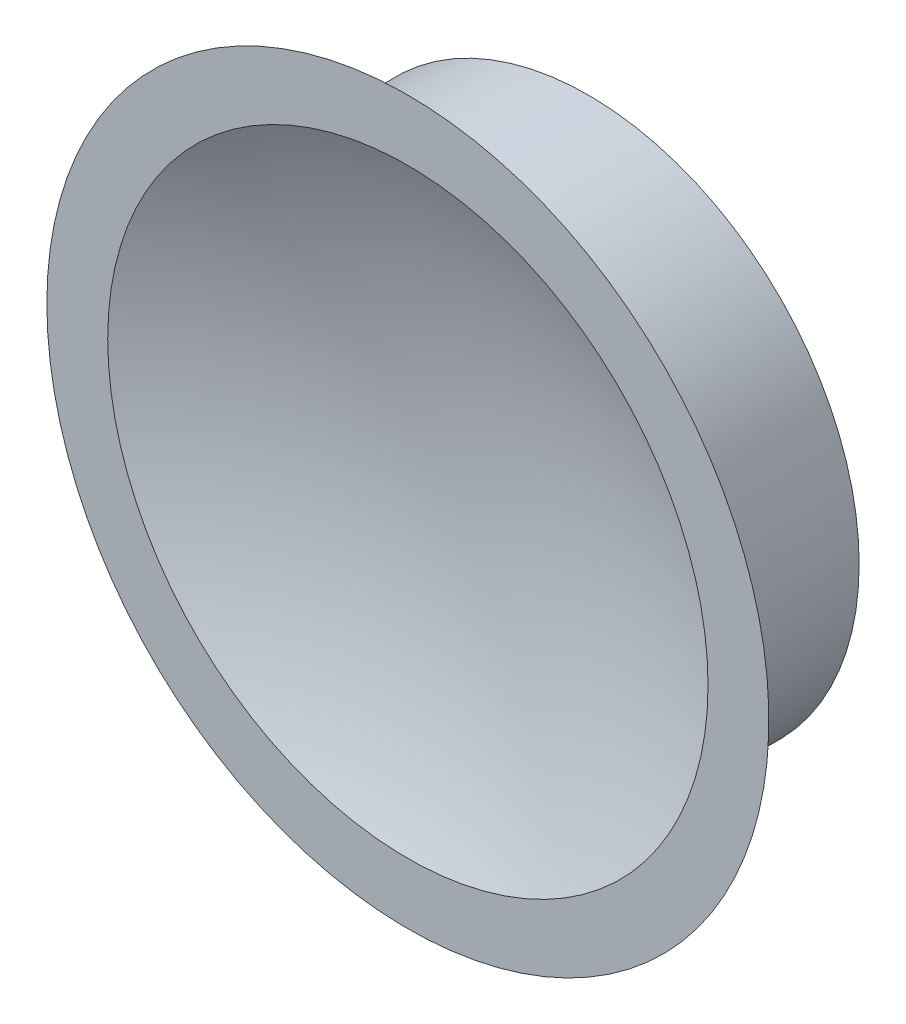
ISO-10303-21;
HEADER;
FILE_DESCRIPTION(('STEP AP214'),'2;1');
FILE_NAME('part.step','',(''),(''),'','','');
FILE_SCHEMA(('AUTOMOTIVE_DESIGN { 1 0 10303 214 1 1 1 1 }'));
ENDSEC;
DATA;
#1=APPLICATION_CONTEXT('core data for automotive mechanical design processes');
#2=APPLICATION_PROTOCOL_DEFINITION('international standard','automotive_design',2000,#1);
#3=PRODUCT_CONTEXT('',#1,'mechanical');
#4=PRODUCT('Part','Part','',(#3));
#5=PRODUCT_RELATED_PRODUCT_CATEGORY('part','',(#4));
#6=PRODUCT_DEFINITION_FORMATION('','',#4);
#7=PRODUCT_DEFINITION_CONTEXT('part definition',#1,'design');
#8=PRODUCT_DEFINITION('design','',#6,#7);
#9=PRODUCT_DEFINITION_SHAPE('','',#8);
#10=(LENGTH_UNIT() NAMED_UNIT(*) SI_UNIT(.MILLI.,.METRE.));
#11=(NAMED_UNIT(*) PLANE_ANGLE_UNIT() SI_UNIT($,.RADIAN.));
#12=(NAMED_UNIT(*) SI_UNIT($,.STERADIAN.) SOLID_ANGLE_UNIT());
#13=UNCERTAINTY_MEASURE_WITH_UNIT(LENGTH_MEASURE(1.E-05),#10,'distance_accuracy_value','');
#14=(GEOMETRIC_REPRESENTATION_CONTEXT(3) GLOBAL_UNCERTAINTY_ASSIGNED_CONTEXT((#13)) GLOBAL_UNIT_ASSIGNED_CONTEXT((#10,
#11,#12)) REPRESENTATION_CONTEXT('',''));
#15=CARTESIAN_POINT('',(0.,0.,0.));
#16=DIRECTION('',(0.,0.,1.));
#17=DIRECTION('',(1.,0.,0.));
#18=AXIS2_PLACEMENT_3D('',#15,#16,#17);
#19=CARTESIAN_POINT('',(0.,0.,0.));
#20=DIRECTION('',(0.,0.,-1.));
#21=DIRECTION('',(-1.,0.,0.));
#22=AXIS2_PLACEMENT_3D('',#19,#20,#21);
#23=PLANE('',#22);
#24=CARTESIAN_POINT('',(12.7,0.,0.));
#25=DIRECTION('',(0.,0.,1.));
#26=DIRECTION('',(1.,0.,0.));
#27=AXIS2_PLACEMENT_3D('',#24,#25,#26);
#28=CIRCLE('',#27,10.5588825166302);
#29=CARTESIAN_POINT('',(23.2588825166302,0.,0.));
#30=VERTEX_POINT('',#29);
#31=EDGE_CURVE('E10',#30,#30,#28,.T.);
#32=ORIENTED_EDGE('',*,*,#31,.F.);
#33=EDGE_LOOP('',(#32));
#34=FACE_BOUND('',#33,.T.);
#35=CARTESIAN_POINT('',(12.7,0.,0.));
#36=DIRECTION('',(0.,0.,1.));
#37=DIRECTION('',(1.,0.,0.));
#38=AXIS2_PLACEMENT_3D('',#35,#36,#37);
#39=CIRCLE('',#38,12.7);
#40=CARTESIAN_POINT('',(0.,0.,0.));
#41=VERTEX_POINT('',#40);
#42=EDGE_CURVE('E62',#41,#41,#39,.T.);
#43=ORIENTED_EDGE('',*,*,#42,.T.);
#44=EDGE_LOOP('',(#43));
#45=FACE_BOUND('',#44,.T.);
#46=ADVANCED_FACE('F45',(#34,#45),#23,.F.);
#47=CARTESIAN_POINT('',(12.7,0.,21.9970452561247));
#48=DIRECTION('',(0.,0.,1.));
#49=DIRECTION('',(-1.,0.,0.));
#50=AXIS2_PLACEMENT_3D('',#47,#48,#49);
#51=SPHERICAL_SURFACE('',#50,24.4);
#52=ORIENTED_EDGE('',*,*,#31,.T.);
#53=EDGE_LOOP('',(#52));
#54=FACE_BOUND('',#53,.T.);
#55=ADVANCED_FACE('F81',(#54),#51,.F.);
#56=CARTESIAN_POINT('',(0.,0.,-6.35));
#57=DIRECTION('',(0.,0.,-1.));
#58=DIRECTION('',(-1.,0.,0.));
#59=AXIS2_PLACEMENT_3D('',#56,#57,#58);
#60=PLANE('',#59);
#61=CARTESIAN_POINT('',(12.7,0.,-6.35));
#62=DIRECTION('',(0.,0.,1.));
#63=DIRECTION('',(1.,0.,0.));
#64=AXIS2_PLACEMENT_3D('',#61,#62,#63);
#65=CIRCLE('',#64,9.525);
#66=CARTESIAN_POINT('',(22.225,0.,-6.35));
#67=VERTEX_POINT('',#66);
#68=EDGE_CURVE('E52',#67,#67,#65,.T.);
#69=ORIENTED_EDGE('',*,*,#68,.F.);
#70=EDGE_LOOP('',(#69));
#71=FACE_BOUND('',#70,.T.);
#72=ADVANCED_FACE('F78',(#71),#60,.T.);
#73=CARTESIAN_POINT('',(12.7,0.,0.));
#74=DIRECTION('',(0.,0.,1.));
#75=DIRECTION('',(1.,0.,0.));
#76=AXIS2_PLACEMENT_3D('',#73,#74,#75);
#77=CYLINDRICAL_SURFACE('',#76,9.525);
#78=ORIENTED_EDGE('',*,*,#68,.T.);
#79=EDGE_LOOP('',(#78));
#80=FACE_BOUND('',#79,.T.);
#81=CARTESIAN_POINT('',(12.7,0.,-1.54938494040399));
#82=DIRECTION('',(0.,0.,1.));
#83=DIRECTION('',(1.,0.,0.));
#84=AXIS2_PLACEMENT_3D('',#81,#82,#83);
#85=CIRCLE('',#84,9.525);
#86=CARTESIAN_POINT('',(3.175,0.,-1.54938494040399));
#87=VERTEX_POINT('',#86);
#88=EDGE_CURVE('E57',#87,#87,#85,.T.);
#89=ORIENTED_EDGE('',*,*,#88,.F.);
#90=EDGE_LOOP('',(#89));
#91=FACE_BOUND('',#90,.T.);
#92=ADVANCED_FACE('F72',(#80,#91),#77,.T.);
#93=CARTESIAN_POINT('',(12.7,0.,21.9970452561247));
#94=DIRECTION('',(0.,0.,1.));
#95=DIRECTION('',(-1.,0.,0.));
#96=AXIS2_PLACEMENT_3D('',#93,#94,#95);
#97=SPHERICAL_SURFACE('',#96,25.4);
#98=CARTESIAN_POINT('',(3.175,0.,-1.54938494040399));
#99=CARTESIAN_POINT('',(3.14085718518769,0.,-1.53557349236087));
#100=CARTESIAN_POINT('',(3.10674441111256,0.,-1.52168778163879));
#101=CARTESIAN_POINT('',(3.0385795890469,0.,-1.49376809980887));
#102=CARTESIAN_POINT('',(3.00452754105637,0.,-1.47973412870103));
#103=CARTESIAN_POINT('',(2.93648481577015,0.,-1.45151819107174));
#104=CARTESIAN_POINT('',(2.90249413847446,0.,-1.43733622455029));
#105=CARTESIAN_POINT('',(2.8345747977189,0.,-1.4088245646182));
#106=CARTESIAN_POINT('',(2.80064613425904,0.,-1.39449487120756));
#107=CARTESIAN_POINT('',(2.73285146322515,0.,-1.36568802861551));
#108=CARTESIAN_POINT('',(2.69898545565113,0.,-1.3512108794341));
#109=CARTESIAN_POINT('',(2.63131673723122,0.,-1.32210939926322));
#110=CARTESIAN_POINT('',(2.59751402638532,0.,-1.30748506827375));
#111=CARTESIAN_POINT('',(2.52997254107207,0.,-1.27808950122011));
#112=CARTESIAN_POINT('',(2.49623376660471,0.,-1.26331826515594));
#113=CARTESIAN_POINT('',(2.42882079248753,0.,-1.23362916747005));
#114=CARTESIAN_POINT('',(2.3951465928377,0.,-1.21871130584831));
#115=CARTESIAN_POINT('',(2.32786340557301,0.,-1.18872923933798));
#116=CARTESIAN_POINT('',(2.29425441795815,0.,-1.17366503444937));
#117=CARTESIAN_POINT('',(2.22710229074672,0.,-1.1433905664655));
#118=CARTESIAN_POINT('',(2.19355915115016,0.,-1.12818030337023));
#119=CARTESIAN_POINT('',(2.12653935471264,0.,-1.09761400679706));
#120=CARTESIAN_POINT('',(2.09306269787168,0.,-1.08225797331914));
#121=CARTESIAN_POINT('',(2.02617650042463,0.,-1.05140042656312));
#122=CARTESIAN_POINT('',(1.99276695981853,0.,-1.03589891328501));
#123=CARTESIAN_POINT('',(1.92601562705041,0.,-1.00475070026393));
#124=CARTESIAN_POINT('',(1.89267383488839,0.,-0.989104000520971));
#125=CARTESIAN_POINT('',(1.82605862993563,0.,-0.957665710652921));
#126=CARTESIAN_POINT('',(1.79278521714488,0.,-0.941874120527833));
#127=CARTESIAN_POINT('',(1.72630740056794,0.,-0.910146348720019));
#128=CARTESIAN_POINT('',(1.69310299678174,0.,-0.894210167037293));
#129=CARTESIAN_POINT('',(1.62676382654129,0.,-0.862193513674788));
#130=CARTESIAN_POINT('',(1.59362906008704,0.,-0.846113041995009));
#131=CARTESIAN_POINT('',(1.52742979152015,0.,-0.813808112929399));
#132=CARTESIAN_POINT('',(1.4943652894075,0.,-0.797583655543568));
#133=CARTESIAN_POINT('',(1.42830717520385,0.,-0.764991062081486));
#134=CARTESIAN_POINT('',(1.39531356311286,0.,-0.748622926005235));
#135=CARTESIAN_POINT('',(1.3293978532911,0.,-0.715743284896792));
#136=CARTESIAN_POINT('',(1.29647575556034,0.,-0.699231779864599));
#137=CARTESIAN_POINT('',(1.23070369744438,0.,-0.666065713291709));
#138=CARTESIAN_POINT('',(1.19785373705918,0.,-0.649411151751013));
#139=CARTESIAN_POINT('',(1.13222657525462,0.,-0.615959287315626));
#140=CARTESIAN_POINT('',(1.09944937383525,0.,-0.599161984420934));
#141=CARTESIAN_POINT('',(1.03396835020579,0.,-0.565424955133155));
#142=CARTESIAN_POINT('',(1.0012645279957,0.,-0.548485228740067));
#143=CARTESIAN_POINT('',(0.935930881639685,0.,-0.514463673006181));
#144=CARTESIAN_POINT('',(0.903301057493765,0.,-0.497381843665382));
#145=CARTESIAN_POINT('',(0.838116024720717,0.,-0.463076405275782));
#146=CARTESIAN_POINT('',(0.805560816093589,0.,-0.44585279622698));
#147=CARTESIAN_POINT('',(0.740525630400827,0.,-0.411264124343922));
#148=CARTESIAN_POINT('',(0.708045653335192,0.,-0.393899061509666));
#149=CARTESIAN_POINT('',(0.643161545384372,0.,-0.35902781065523));
#150=CARTESIAN_POINT('',(0.610757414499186,0.,-0.34152162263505));
#151=CARTESIAN_POINT('',(0.546025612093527,0.,-0.306368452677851));
#152=CARTESIAN_POINT('',(0.513697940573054,0.,-0.288721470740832));
#153=CARTESIAN_POINT('',(0.449119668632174,0.,-0.253287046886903));
#154=CARTESIAN_POINT('',(0.416869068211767,0.,-0.235499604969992));
#155=CARTESIAN_POINT('',(0.352445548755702,0.,-0.199784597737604));
#156=CARTESIAN_POINT('',(0.320272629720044,0.,-0.181857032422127));
#157=CARTESIAN_POINT('',(0.256005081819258,0.,-0.145862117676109));
#158=CARTESIAN_POINT('',(0.223910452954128,0.,-0.127794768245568));
#159=CARTESIAN_POINT('',(0.159800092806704,0.,-0.0915206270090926));
#160=CARTESIAN_POINT('',(0.12778436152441,0.,-0.0733138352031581));
#161=CARTESIAN_POINT('',(0.063832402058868,0.,-0.0367611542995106));
#162=CARTESIAN_POINT('',(0.0318961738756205,0.,-0.0184152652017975));
#163=CARTESIAN_POINT('',(0.,0.,0.));
#164=B_SPLINE_CURVE_WITH_KNOTS('',3,(#98,#99,#100,#101,#102,#103,#104,#105,#106,#107,#108,#109,
#110,#111,#112,#113,#114,#115,#116,#117,#118,#119,#120,#121,#122,#123,#124,#125,#126,#127,#128,
#129,#130,#131,#132,#133,#134,#135,#136,#137,#138,#139,#140,#141,#142,#143,#144,#145,#146,#147,
#148,#149,#150,#151,#152,#153,#154,#155,#156,#157,#158,#159,#160,#161,#162,#163),.UNSPECIFIED.,
.F.,.F.,(4,2,2,2,2,2,2,2,2,2,2,2,2,2,2,2,2,2,2,2,2,2,2,2,2,2,2,2,2,2,2,2,4),(0.,
0.11049150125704,0.220983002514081,0.331474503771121,0.441966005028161,0.552457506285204,
0.662949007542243,0.773440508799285,0.883932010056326,0.99442351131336,1.1049150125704,
1.21540651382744,1.32589801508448,1.43638951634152,1.54688101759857,1.6573725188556,
1.76786402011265,1.87835552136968,1.98884702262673,2.09933852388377,2.20983002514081,
2.32032152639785,2.43081302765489,2.54130452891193,2.65179603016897,2.76228753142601,
2.87277903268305,2.98327053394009,3.09376203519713,3.20425353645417,3.31474503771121,
3.42523653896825,3.53572804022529),.UNSPECIFIED.);
#165=EDGE_CURVE('BSEAM70',#87,#41,#164,.T.);
#166=ORIENTED_EDGE('',*,*,#88,.T.);
#167=ORIENTED_EDGE('',*,*,#42,.F.);
#168=ORIENTED_EDGE('',*,*,#165,.T.);
#169=ORIENTED_EDGE('',*,*,#165,.F.);
#170=EDGE_LOOP('',(#166,#168,#167,#169));
#171=FACE_BOUND('',#170,.T.);
#172=ADVANCED_FACE('F70',(#171),#97,.T.);
#173=CLOSED_SHELL('',(#46,#55,#72,#92,#172));
#174=MANIFOLD_SOLID_BREP('B2',#173);
#175=ADVANCED_BREP_SHAPE_REPRESENTATION('',(#18,#174),#14);
#176=SHAPE_DEFINITION_REPRESENTATION(#9,#175);
ENDSEC;
END-ISO-10303-21;
